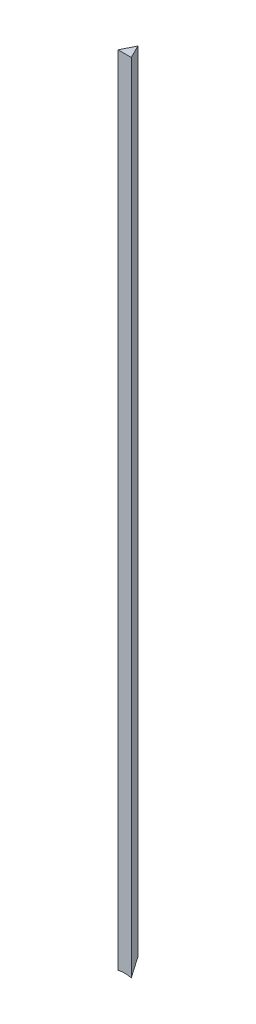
ISO-10303-21;
HEADER;
FILE_DESCRIPTION(('STEP AP214'),'2;1');
FILE_NAME('part.step','',(''),(''),'','','');
FILE_SCHEMA(('AUTOMOTIVE_DESIGN { 1 0 10303 214 1 1 1 1 }'));
ENDSEC;
DATA;
#1=APPLICATION_CONTEXT('core data for automotive mechanical design processes');
#2=APPLICATION_PROTOCOL_DEFINITION('international standard','automotive_design',2000,#1);
#3=PRODUCT_CONTEXT('',#1,'mechanical');
#4=PRODUCT('Part','Part','',(#3));
#5=PRODUCT_RELATED_PRODUCT_CATEGORY('part','',(#4));
#6=PRODUCT_DEFINITION_FORMATION('','',#4);
#7=PRODUCT_DEFINITION_CONTEXT('part definition',#1,'design');
#8=PRODUCT_DEFINITION('design','',#6,#7);
#9=PRODUCT_DEFINITION_SHAPE('','',#8);
#10=(LENGTH_UNIT() NAMED_UNIT(*) SI_UNIT(.MILLI.,.METRE.));
#11=(NAMED_UNIT(*) PLANE_ANGLE_UNIT() SI_UNIT($,.RADIAN.));
#12=(NAMED_UNIT(*) SI_UNIT($,.STERADIAN.) SOLID_ANGLE_UNIT());
#13=UNCERTAINTY_MEASURE_WITH_UNIT(LENGTH_MEASURE(1.E-05),#10,'distance_accuracy_value','');
#14=(GEOMETRIC_REPRESENTATION_CONTEXT(3) GLOBAL_UNCERTAINTY_ASSIGNED_CONTEXT((#13)) GLOBAL_UNIT_ASSIGNED_CONTEXT((#10,
#11,#12)) REPRESENTATION_CONTEXT('',''));
#15=CARTESIAN_POINT('',(0.,0.,0.));
#16=DIRECTION('',(0.,0.,1.));
#17=DIRECTION('',(1.,0.,0.));
#18=AXIS2_PLACEMENT_3D('',#15,#16,#17);
#19=CARTESIAN_POINT('',(0.,838.1,0.));
#20=DIRECTION('',(-0.894934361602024,0.,0.44619781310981));
#21=DIRECTION('',(0.44619781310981,0.,0.894934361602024));
#22=AXIS2_PLACEMENT_3D('',#19,#20,#21);
#23=PLANE('',#22);
#24=DIRECTION('',(0.,-1.,0.));
#25=VECTOR('',#24,1.);
#26=CARTESIAN_POINT('',(6.69296719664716,838.1,13.4240154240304));
#27=LINE('',#26,#25);
#28=CARTESIAN_POINT('',(6.69296719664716,838.1,13.4240154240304));
#29=VERTEX_POINT('',#28);
#30=CARTESIAN_POINT('',(6.69296719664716,27.7328763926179,13.4240154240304));
#31=VERTEX_POINT('',#30);
#32=EDGE_CURVE('E85',#29,#31,#27,.T.);
#33=ORIENTED_EDGE('',*,*,#32,.T.);
#34=CARTESIAN_POINT('',(0.,0.,0.));
#35=DIRECTION('',(-0.894934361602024,0.,0.44619781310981));
#36=DIRECTION('',(-0.382391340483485,0.515317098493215,-0.766958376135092));
#37=AXIS2_PLACEMENT_3D('',#34,#35,#36);
#38=ELLIPSE('',#37,101.079692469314,31.5);
#39=CARTESIAN_POINT('',(0.,36.127327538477,0.));
#40=VERTEX_POINT('',#39);
#41=EDGE_CURVE('E51',#31,#40,#38,.T.);
#42=ORIENTED_EDGE('',*,*,#41,.T.);
#43=DIRECTION('',(0.,-1.,0.));
#44=VECTOR('',#43,1.);
#45=CARTESIAN_POINT('',(0.,838.1,0.));
#46=LINE('',#45,#44);
#47=CARTESIAN_POINT('',(0.,838.1,0.));
#48=VERTEX_POINT('',#47);
#49=EDGE_CURVE('E44',#48,#40,#46,.T.);
#50=ORIENTED_EDGE('',*,*,#49,.F.);
#51=DIRECTION('',(-0.44619781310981,0.,-0.894934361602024));
#52=VECTOR('',#51,1.);
#53=CARTESIAN_POINT('',(0.,838.1,0.));
#54=LINE('',#53,#52);
#55=EDGE_CURVE('E93',#29,#48,#54,.T.);
#56=ORIENTED_EDGE('',*,*,#55,.F.);
#57=EDGE_LOOP('',(#33,#42,#50,#56));
#58=FACE_BOUND('',#57,.T.);
#59=ADVANCED_FACE('F37',(#58),#23,.F.);
#60=CARTESIAN_POINT('',(0.,838.1,0.));
#61=DIRECTION('',(0.894934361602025,0.,0.446197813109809));
#62=DIRECTION('',(0.446197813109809,0.,-0.894934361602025));
#63=AXIS2_PLACEMENT_3D('',#60,#61,#62);
#64=PLANE('',#63);
#65=ORIENTED_EDGE('',*,*,#49,.T.);
#66=CARTESIAN_POINT('',(0.,0.,0.));
#67=DIRECTION('',(0.894934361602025,0.,0.446197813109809));
#68=DIRECTION('',(0.371950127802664,0.552369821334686,-0.746016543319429));
#69=AXIS2_PLACEMENT_3D('',#66,#67,#68);
#70=ELLIPSE('',#69,68.0639448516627,31.5);
#71=CARTESIAN_POINT('',(-6.69296719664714,27.8150797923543,13.4240154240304));
#72=VERTEX_POINT('',#71);
#73=EDGE_CURVE('E71',#40,#72,#70,.T.);
#74=ORIENTED_EDGE('',*,*,#73,.T.);
#75=DIRECTION('',(0.,-1.,0.));
#76=VECTOR('',#75,1.);
#77=CARTESIAN_POINT('',(-6.69296719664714,838.1,13.4240154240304));
#78=LINE('',#77,#76);
#79=CARTESIAN_POINT('',(-6.69296719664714,838.1,13.4240154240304));
#80=VERTEX_POINT('',#79);
#81=EDGE_CURVE('E79',#80,#72,#78,.T.);
#82=ORIENTED_EDGE('',*,*,#81,.F.);
#83=DIRECTION('',(-0.446197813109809,0.,0.894934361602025));
#84=VECTOR('',#83,1.);
#85=CARTESIAN_POINT('',(0.,838.1,0.));
#86=LINE('',#85,#84);
#87=EDGE_CURVE('E91',#48,#80,#86,.T.);
#88=ORIENTED_EDGE('',*,*,#87,.F.);
#89=EDGE_LOOP('',(#65,#74,#82,#88));
#90=FACE_BOUND('',#89,.T.);
#91=ADVANCED_FACE('F78',(#90),#64,.F.);
#92=CARTESIAN_POINT('',(-6.69296719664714,838.1,13.4240154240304));
#93=DIRECTION('',(0.,0.,-1.));
#94=DIRECTION('',(-1.,0.,0.));
#95=AXIS2_PLACEMENT_3D('',#92,#93,#94);
#96=PLANE('',#95);
#97=ORIENTED_EDGE('',*,*,#81,.T.);
#98=CARTESIAN_POINT('',(1.30642405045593,-7.5743449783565,13.4240154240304));
#99=DIRECTION('',(0.,0.,-1.));
#100=DIRECTION('',(-0.169970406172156,0.985449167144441,0.));
#101=AXIS2_PLACEMENT_3D('',#98,#99,#100);
#102=ELLIPSE('',#101,36.2980083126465,31.5);
#103=EDGE_CURVE('E11',#72,#31,#102,.T.);
#104=ORIENTED_EDGE('',*,*,#103,.T.);
#105=ORIENTED_EDGE('',*,*,#32,.F.);
#106=DIRECTION('',(1.,0.,0.));
#107=VECTOR('',#106,1.);
#108=CARTESIAN_POINT('',(-6.69296719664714,838.1,13.4240154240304));
#109=LINE('',#108,#107);
#110=EDGE_CURVE('E58',#80,#29,#109,.T.);
#111=ORIENTED_EDGE('',*,*,#110,.F.);
#112=EDGE_LOOP('',(#97,#104,#105,#111));
#113=FACE_BOUND('',#112,.T.);
#114=ADVANCED_FACE('F83',(#113),#96,.F.);
#115=CARTESIAN_POINT('',(0.,838.1,0.));
#116=DIRECTION('',(0.,1.,0.));
#117=DIRECTION('',(0.,0.,1.));
#118=AXIS2_PLACEMENT_3D('',#115,#116,#117);
#119=PLANE('',#118);
#120=ORIENTED_EDGE('',*,*,#55,.T.);
#121=ORIENTED_EDGE('',*,*,#87,.T.);
#122=ORIENTED_EDGE('',*,*,#110,.T.);
#123=EDGE_LOOP('',(#120,#121,#122));
#124=FACE_BOUND('',#123,.T.);
#125=ADVANCED_FACE('F98',(#124),#119,.T.);
#126=CARTESIAN_POINT('',(1.03161392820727,-5.98105934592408,10.6002344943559));
#127=DIRECTION('',(-0.0844558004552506,0.489655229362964,-0.86781620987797));
#128=DIRECTION('',(0.,0.870927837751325,0.491410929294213));
#129=AXIS2_PLACEMENT_3D('',#126,#127,#128);
#130=CYLINDRICAL_SURFACE('',#129,31.5);
#131=ORIENTED_EDGE('',*,*,#103,.F.);
#132=ORIENTED_EDGE('',*,*,#73,.F.);
#133=ORIENTED_EDGE('',*,*,#41,.F.);
#134=EDGE_LOOP('',(#131,#132,#133));
#135=FACE_BOUND('',#134,.T.);
#136=ADVANCED_FACE('F70',(#135),#130,.F.);
#137=CLOSED_SHELL('',(#59,#91,#114,#125,#136));
#138=MANIFOLD_SOLID_BREP('B2',#137);
#139=ADVANCED_BREP_SHAPE_REPRESENTATION('',(#18,#138),#14);
#140=SHAPE_DEFINITION_REPRESENTATION(#9,#139);
ENDSEC;
END-ISO-10303-21;
